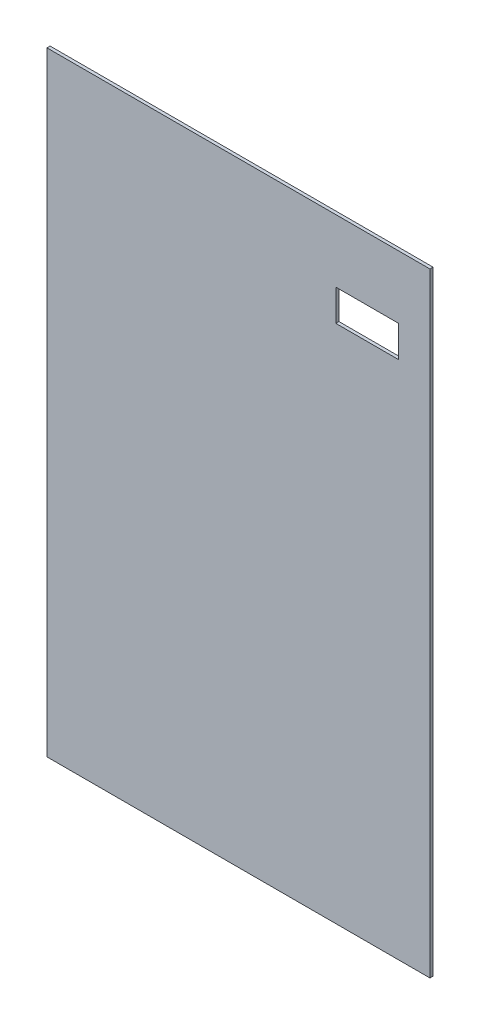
from build123d import *

# Parameters (mm, degrees)
SKETCH1_W           = 1220
SKETCH1_H           = 1955.8
BOSS_EXTRUDE1_DEPTH = 10
SKETCH2_W           = 200
SKETCH2_H           = 100
CUT_EXTRUDE1_DEPTH  = 2306.136360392


with BuildPart() as part:
    # Sketch1 → Boss-Extrude1 (new body)
    with BuildSketch(Plane.XY):
        with Locations((610, 977.9)):
            Rectangle(SKETCH1_W, SKETCH1_H)
    extrude(amount=BOSS_EXTRUDE1_DEPTH)

    # Sketch2 → Cut-Extrude1 (cut, through all)
    with BuildSketch(Plane.XY.offset(10)):
        with Locations((1020, 1705.8)):
            Rectangle(SKETCH2_W, SKETCH2_H)
    extrude(amount=-CUT_EXTRUDE1_DEPTH, mode=Mode.SUBTRACT)


solid = part.part
